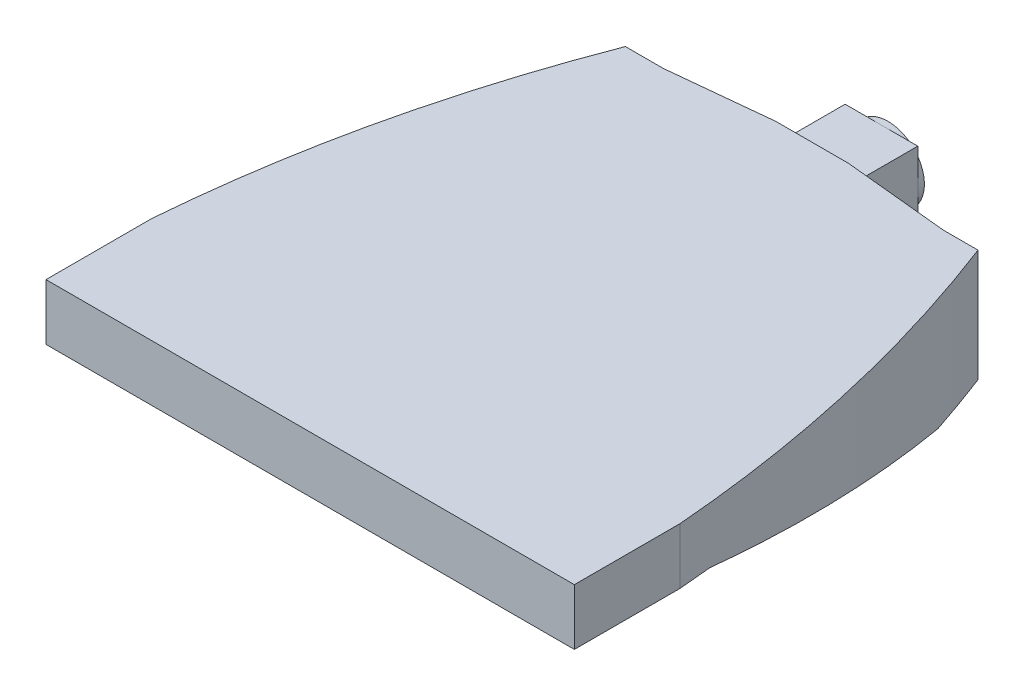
from build123d import *

# Parameters (mm, degrees)
SCHIZZO1_W                   = 5.5
SCHIZZO1_H                   = 10.5
ESTRUSIONE_ESTRUSIONE1_DEPTH = 17
SCHIZZO2_W                   = 10.5
SCHIZZO2_H                   = 3
TAGLIO_ESTRUSIONE1_DEPTH     = 11
SCHIZZO3_W                   = 16
SCHIZZO3_H                   = 8.5
TAGLIO_ESTRUSIONE2_DEPTH     = 80
SCHIZZO4_R                   = 5.5
ESTRUSIONE_ESTRUSIONE2_DEPTH = 1
SCHIZZO5_W                   = 88.761009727
SCHIZZO5_H                   = 120.396008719
TAGLIO_ESTRUSIONE3_DEPTH     = 17


with BuildPart() as part:
    # Schizzo1 → Estrusione-Estrusione1 (new body)
    with BuildSketch(Plane(origin=(0, 0, 0), x_dir=(1, 0, 0), z_dir=(0, 1, 0))):
        with BuildLine():
            Line((-25.5, -7.940684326), (-25.5, -23.940684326))
            Line((-25.5, -23.940684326), (14.5, -23.940684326))
            Line((14.5, -23.940684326), (14.5, 50.482324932))
            Line((14.5, 50.482324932), (-6.426602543, 50.482324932))
            Line((-6.426602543, 50.482324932), (-12.194702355, 50.482324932))
            add(Edge.make_bspline(
                [(-25.5, -7.940684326), (-23.065033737, 22.226764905), (-12.194702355, 50.482324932)],
                knots=[0, 0, 0, 1, 1, 1], degree=2))
        make_face()
        with BuildLine():
            Line((14.5, 50.482324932), (14.5, -23.940684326))
            Line((14.5, -23.940684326), (54.5, -23.940684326))
            Line((54.5, -23.940684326), (54.5, -7.940684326))
            add(Edge.make_bspline(
                [(54.5, -7.940684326), (52.065033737, 22.226764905), (41.194702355, 50.482324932)],
                knots=[0, 0, 0, 1, 1, 1], degree=2))
            Line((41.194702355, 50.482324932), (35.927202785, 50.482324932))
            Line((35.927202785, 50.482324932), (14.5, 50.482324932))
        make_face()
        with Locations((11.75, 57.309315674)):
            Rectangle(SCHIZZO1_W, SCHIZZO1_H)
        with Locations((17.25, 57.309315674)):
            Rectangle(SCHIZZO1_W, SCHIZZO1_H)
        Polygon((14.5, 52.059315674), (14.5, 50.482324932), (35.927202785, 50.482324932), (20, 52.059315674), align=None)
        Polygon((-6.426602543, 50.482324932), (14.5, 50.482324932), (14.5, 52.059315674), (9, 52.059315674), align=None)
    extrude(amount=ESTRUSIONE_ESTRUSIONE1_DEPTH)

    # Schizzo2 → Taglio-Estrusione1 (cut)
    with BuildSketch(Plane(origin=(20, 0, 0), x_dir=(0, 0, -1), z_dir=(1, 0, 0))):
        with Locations((57.309315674, 15.5)):
            Rectangle(SCHIZZO2_W, SCHIZZO2_H)
        with Locations((57.309315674, 1.5)):
            Rectangle(SCHIZZO2_W, SCHIZZO2_H)
    extrude(amount=-TAGLIO_ESTRUSIONE1_DEPTH, mode=Mode.SUBTRACT)

    # Schizzo3 → Taglio-Estrusione2 (cut)
    with BuildSketch(Plane(origin=(54.5, 0, 0), x_dir=(0, 0, -1), z_dir=(1, 0, 0))):
        Polygon((-7.940684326, 17), (-7.940684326, 8.5), (-2.941465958, 8.5), (41.027097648, 17), align=None)
        with Locations((-15.940684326, 12.75)):
            Rectangle(SCHIZZO3_W, SCHIZZO3_H)
    extrude(amount=-TAGLIO_ESTRUSIONE2_DEPTH, mode=Mode.SUBTRACT)

    # Schizzo4 → Estrusione-Estrusione2 (add)
    with BuildSketch(Plane(origin=(0, 0, -62.559315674), x_dir=(-1, 0, 0), z_dir=(0, 0, -1))):
        with Locations((-14.5, 8.5)):
            Circle(SCHIZZO4_R)
    extrude(amount=ESTRUSIONE_ESTRUSIONE2_DEPTH)

    # Specchia1: part across plane


with BuildPart() as part_1:
    add(part.part)
    add(part.part.mirror(Plane.ZX))

    # Schizzo5 → Taglio-Estrusione3 (cut)
    with BuildSketch(Plane(origin=(0, 17, 0), x_dir=(1, 0, 0), z_dir=(0, 1, 0))):
        with Locations((15.811898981, 19.288346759)):
            Rectangle(SCHIZZO5_W, SCHIZZO5_H)
    extrude(amount=-TAGLIO_ESTRUSIONE3_DEPTH, mode=Mode.SUBTRACT)


solid = part_1.part
